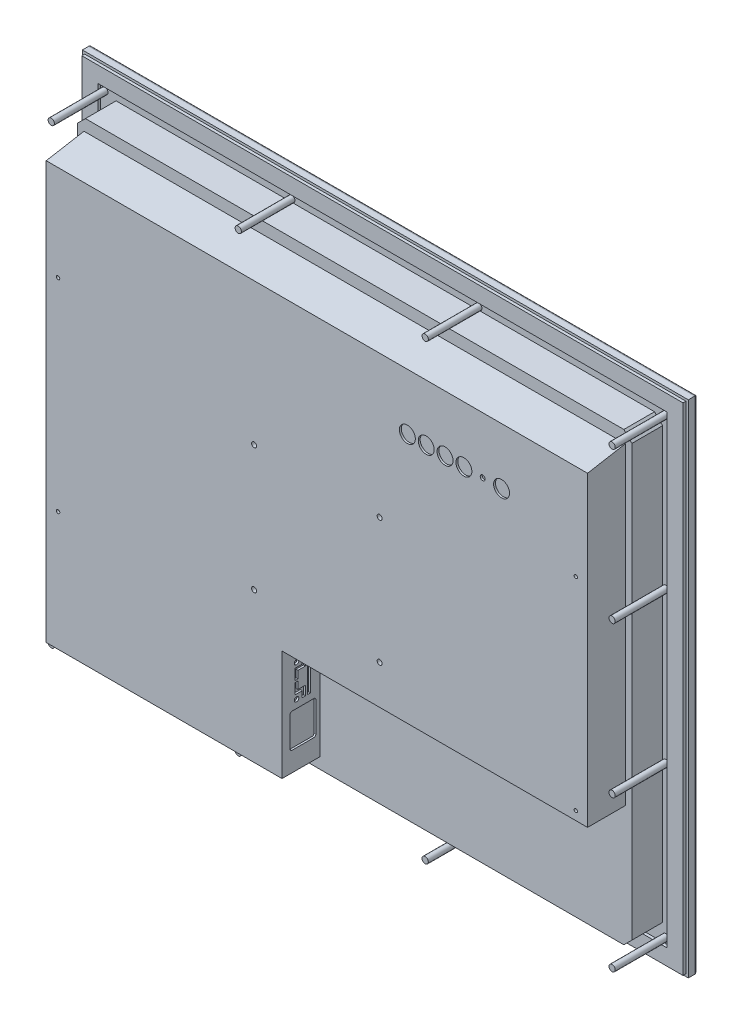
from build123d import *

# Parameters (mm, degrees)
SKETCH1_W                                 = 482.6
SKETCH1_H                                 = 398.78
BEZEL_DEPTH                               = 7.112
BEZEL_RADIUS_R                            = 2
SKETCH2_W                                 = 409.194
SKETCH2_H                                 = 307.594
WINDOW_DEPTH                              = 2.35
SKETCH3_W                                 = 478.79
SKETCH3_H                                 = 394.97
SKETCH3_W_2                               = 453.39
SKETCH3_H_2                               = 369.57
GASKET_DEPTH                              = 2.3
SKETCH5_R                                 = 2.5
PANEL_FRAME_STUDS_DEPTH                   = 42.7
BODY_DEPTH                                = 24.4348
REAR_COVER_DEPTH                          = 30.0482
REAR_COVER_SLOPE_ANGLE                    = 10
F_4_0MM_VESA_HOLES_AT_2_COUNT             = 2
F_4_0MM_VESA_HOLES_AT_2_PITCH             = 100
F_4_0MM_VESA_HOLES_AT_3_COUNT             = 2
F_4_0MM_VESA_HOLES_AT_3_PITCH             = 141.421356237
F_4_0MM_VESA_HOLES_AT_4_COUNT             = 2
F_4_0MM_VESA_HOLES_AT_4_PITCH             = 100
SKETCH10_R                                = 1.5875
VIDEO_TOUCH_INTERFACE_DEPTH               = 1.524
SKETCH11_R                                = 1.7907
SKETCH11_W                                = 2.54
SKETCH11_H                                = 27.94
POWER_AC_AND_DC_DEPTH                     = 1.524
SKETCH12_R                                = 6.35
SKETCH12_R_2                              = 1.9812
CONTROLS_BUTTONS_DEPTH                    = 1.524
F_6_32_ACCESSORY_BRACKET_HOLES_AT_2_COUNT = 2
F_6_32_ACCESSORY_BRACKET_HOLES_AT_2_PITCH = 161.3408
F_6_32_ACCESSORY_BRACKET_HOLES_AT_3_COUNT = 2
F_6_32_ACCESSORY_BRACKET_HOLES_AT_3_PITCH = 442.737175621
F_6_32_ACCESSORY_BRACKET_HOLES_AT_4_COUNT = 2
F_6_32_ACCESSORY_BRACKET_HOLES_AT_4_PITCH = 412.2928


with BuildPart() as part:
    # Sketch1 → Bezel (new body)
    with BuildSketch(Plane.XY):
        Rectangle(SKETCH1_W, SKETCH1_H)
    extrude(amount=-BEZEL_DEPTH)

    # Bezel Radius
    bezel_radius_edges = [part.edges().sort_by_distance(p)[0] for p in [
        (241.3, 0, -7.112),
        (0, 199.39, -7.112),
        (-241.3, 0, -7.112),
        (0, -199.39, -7.112),
    ]]
    fillet(bezel_radius_edges, radius=BEZEL_RADIUS_R)

    # Sketch2 → Window (cut)
    with BuildSketch(Plane(origin=(0, 0, -7.112), x_dir=(-1, 0, 0), z_dir=(0, 0, -1))):
        Rectangle(SKETCH2_W, SKETCH2_H)
    extrude(amount=-WINDOW_DEPTH, mode=Mode.SUBTRACT)

    # Sketch3 → Gasket (add)
    with BuildSketch(Plane.XY):
        Rectangle(SKETCH3_W, SKETCH3_H)
        Rectangle(SKETCH3_W_2, SKETCH3_H_2, mode=Mode.SUBTRACT)
    extrude(amount=GASKET_DEPTH)

    # Sketch5 → Panel Frame Studs (add)
    with BuildSketch(Plane.XY):
        with Locations(Location((-223.3168, 180.213, 0), (0, 0, 180))):
            Circle(SKETCH5_R)
        with Locations(Location((-223.3168, -180.213, 0), (0, 0, 180))):
            Circle(SKETCH5_R)
        with Locations(Location((-74.438933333, 180.213, 0), (0, 0, 180))):
            Circle(SKETCH5_R)
        with Locations(Location((-74.438933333, -180.213, 0), (0, 0, 180))):
            Circle(SKETCH5_R)
        with Locations(Location((74.438933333, 180.213, 0), (0, 0, 180))):
            Circle(SKETCH5_R)
        with Locations(Location((74.438933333, -180.213, 0), (0, 0, 180))):
            Circle(SKETCH5_R)
        with Locations(Location((223.3168, 180.213, 0), (0, 0, 180))):
            Circle(SKETCH5_R)
        with Locations(Location((223.3168, -180.213, 0), (0, 0, 180))):
            Circle(SKETCH5_R)
        with Locations(Location((-223.3168, 60.071, 0), (0, 0, 180))):
            Circle(SKETCH5_R)
        with Locations(Location((223.3168, 60.071, 0), (0, 0, 180))):
            Circle(SKETCH5_R)
        with Locations(Location((-223.3168, -60.071, 0), (0, 0, 180))):
            Circle(SKETCH5_R)
        with Locations(Location((223.3168, -60.071, 0), (0, 0, 180))):
            Circle(SKETCH5_R)
    extrude(amount=PANEL_FRAME_STUDS_DEPTH)


with BuildPart() as body_2:
    # Sketch6 → Body (new body)
    with BuildSketch(Plane.XY):
        Polygon((-220.8168, 171.30109713), (-214.40489713, 177.713), (214.40489713, 177.713), (220.8168, 171.30109713), (220.8168, -171.30109713), (214.40489713, -177.713), (-214.40489713, -177.713), (-220.8168, -171.30109713), align=None)
    extrude(amount=BODY_DEPTH)


with BuildPart() as body_3:
    # Sketch7 → Rear Cover (new body)
    with BuildSketch(Plane.XY.offset(24.4348)):
        Polygon((-215.5571, 168.402), (215.5571, 168.402), (215.5571, -81.153), (-27.7749, -81.153), (-27.7749, -169.164), (-215.5571, -169.164), align=None)
    extrude(amount=REAR_COVER_DEPTH)

    # Rear Cover Slope
    rear_cover_slope_faces = [body_3.faces().sort_by_distance(p)[0] for p in [
        (0, 168.402, 39.4589),
    ]]
    draft(rear_cover_slope_faces, Plane.XY.offset(24.4348), REAR_COVER_SLOPE_ANGLE)

    # Sketch9 → 4.0mm VESA Holes (revolve, cut)
    with BuildSketch(Plane(origin=(-50.0126, 49.962, 54.483), x_dir=(0, -1, 0), z_dir=(1, 0, 0))):
        Polygon((0, 0), (0, 17.203721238), (2, 16.002), (2, 0), align=None)
    f_4_0mm_vesa_holes = revolve(axis=Axis((-50.0126, 49.962, 60.833), (0, 0, -1)), mode=Mode.SUBTRACT)

    # 4.0mm VESA Holes at 2: 4.0mm VESA Holes ×2
    with Locations(*[(i * F_4_0MM_VESA_HOLES_AT_2_PITCH, 0, 0) for i in range(1, F_4_0MM_VESA_HOLES_AT_2_COUNT)]):
        add(f_4_0mm_vesa_holes, mode=Mode.SUBTRACT)

    # 4.0mm VESA Holes at 3: 4.0mm VESA Holes ×2
    with Locations(*[Vector(0.7071067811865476, -0.7071067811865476, 0) * (i * F_4_0MM_VESA_HOLES_AT_3_PITCH) for i in range(1, F_4_0MM_VESA_HOLES_AT_3_COUNT)]):
        add(f_4_0mm_vesa_holes, mode=Mode.SUBTRACT)

    # 4.0mm VESA Holes at 4: 4.0mm VESA Holes ×2
    with Locations(*[(0, -i * F_4_0MM_VESA_HOLES_AT_4_PITCH, 0) for i in range(1, F_4_0MM_VESA_HOLES_AT_4_COUNT)]):
        add(f_4_0mm_vesa_holes, mode=Mode.SUBTRACT)

    # Sketch10 → Video _ Touch Interface (cut)
    with BuildSketch(Plane(origin=(0, -81.153, 0), x_dir=(1, 0, 0), z_dir=(0, 1, 0))):
        with Locations((78.553905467, -35.97331993)):
            Circle(SKETCH10_R)
        with Locations((46.041905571, -35.97331993)):
            Circle(SKETCH10_R)
        with Locations((112.468305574, -37.49731993)):
            Circle(SKETCH10_R)
        with Locations((87.468311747, -37.49731993)):
            Circle(SKETCH10_R)
        with Locations((132.137734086, -36.48131993)):
            Circle(SKETCH10_R)
        with Locations((157.137727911, -36.48131993)):
            Circle(SKETCH10_R)
        with BuildLine():
            Line((75.95990861, -38.51331993), (75.95990861, -33.43331993))
            ThreePointArc((75.95990861, -33.43331993), (75.07443367, -31.233615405), (72.911908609, -30.260860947))
            Line((72.911908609, -30.260860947), (51.683902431, -30.260860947))
            ThreePointArc((51.683902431, -30.260860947), (49.52137737, -31.233615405), (48.63590243, -33.43331993))
            Line((48.63590243, -33.43331993), (48.63590243, -38.51331993))
            ThreePointArc((48.63590243, -38.51331993), (49.52137737, -40.713024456), (51.683902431, -41.685778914))
            Line((51.683902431, -41.685778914), (72.911908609, -41.685778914))
            ThreePointArc((72.911908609, -41.685778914), (75.07443367, -40.713024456), (75.95990861, -38.51331993))
        make_face()
        with BuildLine():
            Line((110.128269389, -34.94461993), (110.128269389, -40.02461993))
            ThreePointArc((110.128269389, -40.02461993), (109.242794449, -42.224324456), (107.08026939, -43.197078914))
            Line((107.08026939, -43.197078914), (92.856269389, -43.197078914))
            ThreePointArc((92.856269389, -43.197078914), (90.693744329, -42.224324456), (89.808269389, -40.02461993))
            Line((89.808269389, -40.02461993), (89.808269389, -34.94461993))
            ThreePointArc((89.808269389, -34.94461993), (90.69374433, -32.744915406), (92.856269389, -31.772160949))
            Line((92.856269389, -31.772160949), (106.952697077, -31.769619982))
            ThreePointArc((106.952697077, -31.769619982), (109.198131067, -32.699353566), (110.128269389, -34.94461993))
        make_face()
        with BuildLine():
            Line((134.477691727, -33.954019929), (134.477691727, -39.03401993))
            ThreePointArc((134.477691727, -39.03401993), (135.363166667, -41.233724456), (137.525691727, -42.206478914))
            Line((137.525691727, -42.206478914), (151.622119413, -42.20901988))
            ThreePointArc((151.622119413, -42.20901988), (153.867553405, -41.279286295), (154.797691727, -39.03401993))
            Line((154.797691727, -39.03401993), (154.797691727, -33.95401993))
            ThreePointArc((154.797691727, -33.95401993), (153.912216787, -31.754315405), (151.749691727, -30.781560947))
            Line((151.749691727, -30.781560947), (137.525691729, -30.781560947))
            ThreePointArc((137.525691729, -30.781560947), (135.363166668, -31.754315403), (134.477691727, -33.954019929))
        make_face()
        with BuildLine():
            Line((186.416303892, -30.38531993), (170.414303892, -30.38531993))
            Line((170.414303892, -30.38531993), (170.414303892, -34.89381993))
            Line((170.414303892, -34.89381993), (165.969303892, -34.89381993))
            ThreePointArc((165.969303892, -34.89381993), (164.381803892, -36.48131993), (165.969303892, -38.06881993))
            Line((165.969303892, -38.06881993), (170.414303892, -38.06881993))
            Line((170.414303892, -38.06881993), (170.414303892, -42.57731993))
            Line((170.414303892, -42.57731993), (186.416303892, -42.57731993))
            Line((186.416303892, -42.57731993), (186.416303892, -38.06881993))
            Line((186.416303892, -38.06881993), (190.861303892, -38.06881993))
            ThreePointArc((190.861303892, -38.06881993), (192.448803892, -36.48131993), (190.861303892, -34.89381993))
            Line((190.861303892, -34.89381993), (186.416303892, -34.89381993))
            Line((186.416303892, -34.89381993), (186.416303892, -30.38531993))
        make_face()
    extrude(amount=VIDEO_TOUCH_INTERFACE_DEPTH, mode=Mode.SUBTRACT)

    # Sketch11 → Power AC and DC (cut)
    with BuildSketch(Plane.ZY.offset(27.7749)):
        with Locations(Location((42.926, -120.222396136, 0), (0, 0, 180))):
            Circle(SKETCH11_R)
        with Locations(Location((42.926, -94.644596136, 0), (0, 0, 180))):
            Circle(SKETCH11_R)
        Polygon((38.4302, -121.403496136), (38.4302, -116.590196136), (44.323, -116.590196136), (44.323, -108.195496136), (41.783, -108.195496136), (41.783, -114.050196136), (35.8902, -114.050196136), (35.8902, -121.403496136), align=None)
        with Locations((33.0962, -107.433496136)):
            Rectangle(SKETCH11_W, SKETCH11_H)
        Polygon((35.8902, -93.463496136), (38.4302, -93.463496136), (38.4302, -98.276796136), (44.323, -98.276796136), (44.323, -106.671496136), (41.783, -106.671496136), (41.783, -100.816796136), (35.8902, -100.816796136), align=None)
        with BuildLine():
            Line((27.571943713, -128.13565365), (27.571943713, -152.07515204))
            ThreePointArc((27.571943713, -152.07515204), (28.017759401, -153.152228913), (29.094377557, -153.599151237))
            Line((29.094377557, -153.599151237), (46.545752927, -153.599151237))
            ThreePointArc((46.545752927, -153.599151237), (47.623383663, -153.15278197), (48.069752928, -152.075151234))
            Line((48.069752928, -152.075151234), (48.069752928, -128.135652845))
            ThreePointArc((48.069752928, -128.135652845), (47.62393724, -127.058575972), (46.547319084, -126.61165365))
            Line((46.547319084, -126.61165365), (29.095943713, -126.61165365))
            ThreePointArc((29.095943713, -126.61165365), (28.018312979, -127.058022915), (27.571943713, -128.13565365))
        make_face()
    extrude(amount=POWER_AC_AND_DC_DEPTH, mode=Mode.SUBTRACT)

    # Sketch12 → Controls Buttons (cut)
    with BuildSketch(Plane.XY.offset(54.483)):
        with Locations((72.053258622, 118.221682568)):
            Circle(SKETCH12_R)
        with Locations((87.053258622, 118.221682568)):
            Circle(SKETCH12_R)
        with Locations((102.053258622, 118.221682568)):
            Circle(SKETCH12_R)
        with Locations((117.053258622, 118.221682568)):
            Circle(SKETCH12_R)
        with Locations((132.053258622, 118.221682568)):
            Circle(SKETCH12_R_2)
        with Locations((147.053258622, 118.221682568)):
            Circle(SKETCH12_R)
    extrude(amount=-CONTROLS_BUTTONS_DEPTH, mode=Mode.SUBTRACT)

    # Sketch14 → 6-32 Accessory Bracket Holes (revolve, cut)
    with BuildSketch(Plane(origin=(-206.121, -74.1934, 54.483), x_dir=(0, -1, 0), z_dir=(1, 0, 0))):
        Polygon((0, 0), (0, 16.81469403), (1.35255, 16.002), (1.35255, 0), align=None)
    f_6_32_accessory_bracket_holes = revolve(axis=Axis((-206.121, -74.1934, 60.833), (0, 0, -1)), mode=Mode.SUBTRACT)

    # 6-32 Accessory Bracket Holes at 2: 6-32 Accessory Bracket Holes ×2
    with Locations(*[(0, i * F_6_32_ACCESSORY_BRACKET_HOLES_AT_2_PITCH, 0) for i in range(1, F_6_32_ACCESSORY_BRACKET_HOLES_AT_2_COUNT)]):
        add(f_6_32_accessory_bracket_holes, mode=Mode.SUBTRACT)

    # 6-32 Accessory Bracket Holes at 3: 6-32 Accessory Bracket Holes ×2
    with Locations(*[Vector(0.931236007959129, 0.3644166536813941, 0) * (i * F_6_32_ACCESSORY_BRACKET_HOLES_AT_3_PITCH) for i in range(1, F_6_32_ACCESSORY_BRACKET_HOLES_AT_3_COUNT)]):
        add(f_6_32_accessory_bracket_holes, mode=Mode.SUBTRACT)

    # 6-32 Accessory Bracket Holes at 4: 6-32 Accessory Bracket Holes ×2
    with Locations(*[(i * F_6_32_ACCESSORY_BRACKET_HOLES_AT_4_PITCH, 0, 0) for i in range(1, F_6_32_ACCESSORY_BRACKET_HOLES_AT_4_COUNT)]):
        add(f_6_32_accessory_bracket_holes, mode=Mode.SUBTRACT)


solid = Compound([part.part, body_2.part, body_3.part])
